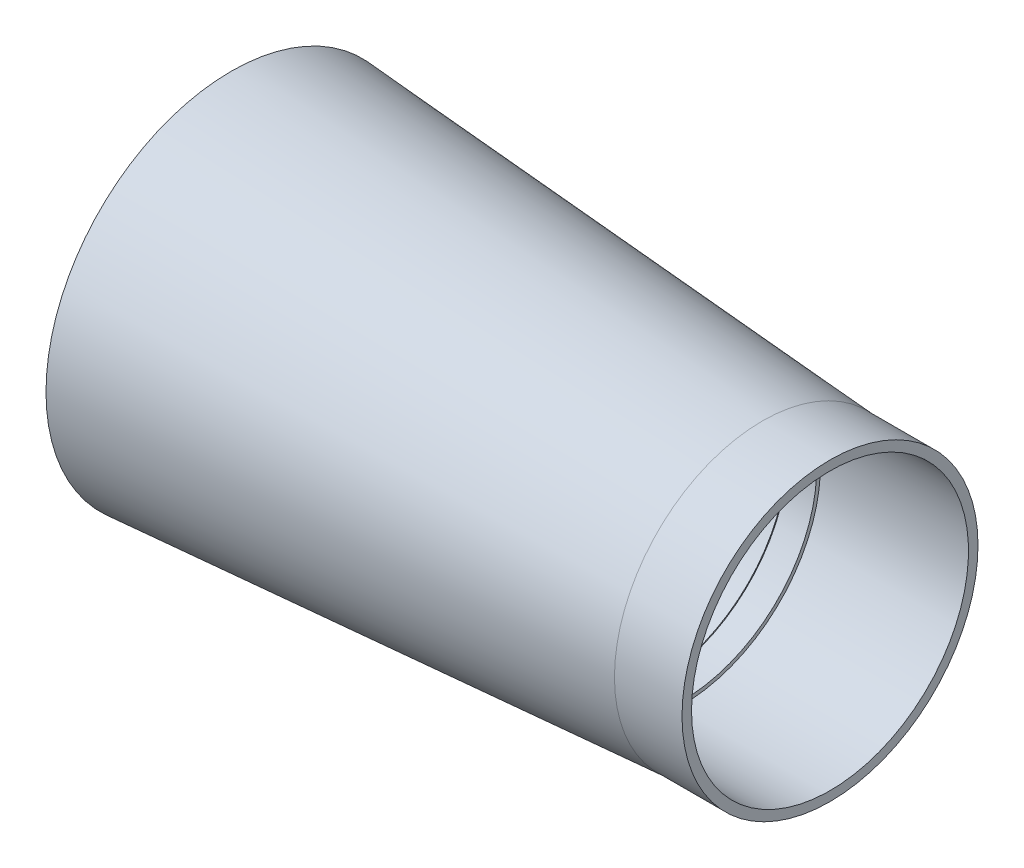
from build123d import *


with BuildPart() as part:
    # Skizze1 → Rotation1 (revolve)
    with BuildSketch(Plane.XY, mode=Mode.PRIVATE) as rotation1_sk:
        Polygon((0, 146), (326, 120), (346, 120), (346, 123), (379, 123), (379, 126.5), (416, 126.5), (416, 127.5), (443, 127.5), (443, 131), (583, 131), (583, 140), (519.1, 140), (16.517447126, 175.144956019), (2, 150), (2, 148), (0, 148), align=None)
    revolve(rotation1_sk.sketch.rotate(Axis((-29.15, 0, 0), (1, 0, 0)), 90), axis=Axis((-29.15, 0, 0), (1, 0, 0)))


solid = part.part
